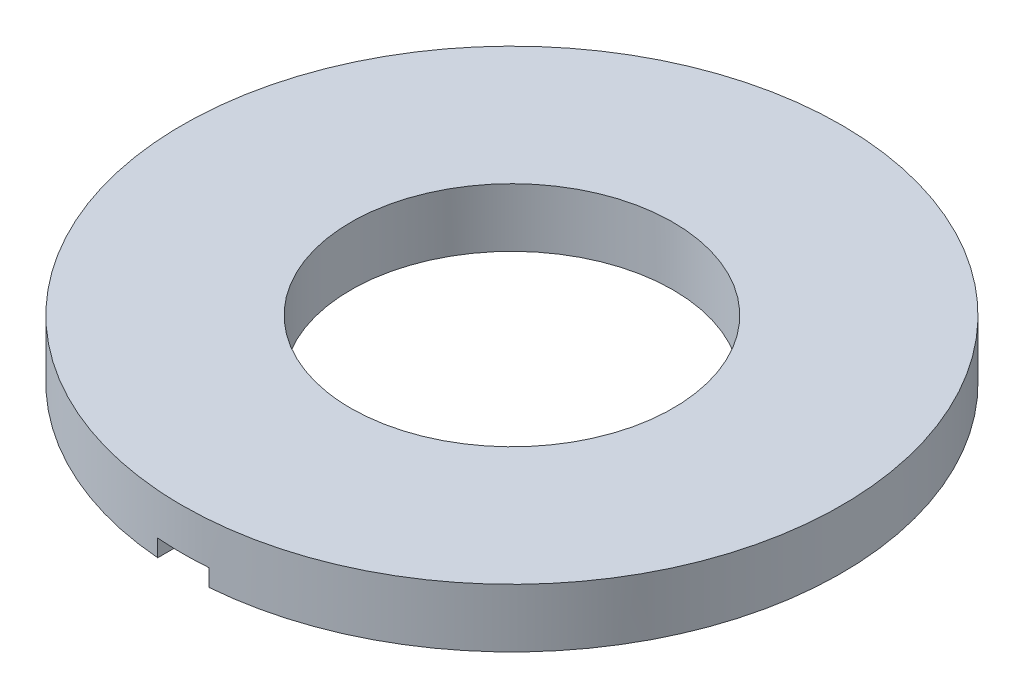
ISO-10303-21;
HEADER;
FILE_DESCRIPTION(('STEP AP214'),'2;1');
FILE_NAME('part.step','',(''),(''),'','','');
FILE_SCHEMA(('AUTOMOTIVE_DESIGN { 1 0 10303 214 1 1 1 1 }'));
ENDSEC;
DATA;
#1=APPLICATION_CONTEXT('core data for automotive mechanical design processes');
#2=APPLICATION_PROTOCOL_DEFINITION('international standard','automotive_design',2000,#1);
#3=PRODUCT_CONTEXT('',#1,'mechanical');
#4=PRODUCT('Part','Part','',(#3));
#5=PRODUCT_RELATED_PRODUCT_CATEGORY('part','',(#4));
#6=PRODUCT_DEFINITION_FORMATION('','',#4);
#7=PRODUCT_DEFINITION_CONTEXT('part definition',#1,'design');
#8=PRODUCT_DEFINITION('design','',#6,#7);
#9=PRODUCT_DEFINITION_SHAPE('','',#8);
#10=(LENGTH_UNIT() NAMED_UNIT(*) SI_UNIT(.MILLI.,.METRE.));
#11=(NAMED_UNIT(*) PLANE_ANGLE_UNIT() SI_UNIT($,.RADIAN.));
#12=(NAMED_UNIT(*) SI_UNIT($,.STERADIAN.) SOLID_ANGLE_UNIT());
#13=UNCERTAINTY_MEASURE_WITH_UNIT(LENGTH_MEASURE(1.E-05),#10,'distance_accuracy_value','');
#14=(GEOMETRIC_REPRESENTATION_CONTEXT(3) GLOBAL_UNCERTAINTY_ASSIGNED_CONTEXT((#13)) GLOBAL_UNIT_ASSIGNED_CONTEXT((#10,
#11,#12)) REPRESENTATION_CONTEXT('',''));
#15=CARTESIAN_POINT('',(0.,0.,0.));
#16=DIRECTION('',(0.,0.,1.));
#17=DIRECTION('',(1.,0.,0.));
#18=AXIS2_PLACEMENT_3D('',#15,#16,#17);
#19=CARTESIAN_POINT('',(0.,0.8,0.));
#20=DIRECTION('',(0.,1.,0.));
#21=DIRECTION('',(0.,0.,1.));
#22=AXIS2_PLACEMENT_3D('',#19,#20,#21);
#23=PLANE('',#22);
#24=CARTESIAN_POINT('',(0.,0.8,0.));
#25=DIRECTION('',(0.,1.,0.));
#26=DIRECTION('',(0.,0.,1.));
#27=AXIS2_PLACEMENT_3D('',#24,#25,#26);
#28=CIRCLE('',#27,4.5);
#29=CARTESIAN_POINT('',(0.,0.8,4.5));
#30=VERTEX_POINT('',#29);
#31=EDGE_CURVE('E113',#30,#30,#28,.T.);
#32=ORIENTED_EDGE('',*,*,#31,.T.);
#33=EDGE_LOOP('',(#32));
#34=FACE_BOUND('',#33,.T.);
#35=CARTESIAN_POINT('',(0.,0.8,0.));
#36=DIRECTION('',(0.,1.,0.));
#37=DIRECTION('',(0.,0.,1.));
#38=AXIS2_PLACEMENT_3D('',#35,#36,#37);
#39=CIRCLE('',#38,2.2);
#40=CARTESIAN_POINT('',(0.,0.8,2.2));
#41=VERTEX_POINT('',#40);
#42=EDGE_CURVE('E102',#41,#41,#39,.T.);
#43=ORIENTED_EDGE('',*,*,#42,.F.);
#44=EDGE_LOOP('',(#43));
#45=FACE_BOUND('',#44,.T.);
#46=ADVANCED_FACE('F39',(#34,#45),#23,.T.);
#47=CARTESIAN_POINT('',(0.,0.,0.));
#48=DIRECTION('',(0.,1.,0.));
#49=DIRECTION('',(0.,0.,1.));
#50=AXIS2_PLACEMENT_3D('',#47,#48,#49);
#51=PLANE('',#50);
#52=CARTESIAN_POINT('',(0.,0.,0.));
#53=DIRECTION('',(0.,1.,0.));
#54=DIRECTION('',(0.,0.,1.));
#55=AXIS2_PLACEMENT_3D('',#52,#53,#54);
#56=CIRCLE('',#55,4.5);
#57=CARTESIAN_POINT('',(0.35,0.,4.48636824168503));
#58=VERTEX_POINT('',#57);
#59=CARTESIAN_POINT('',(-0.35,0.,4.48636824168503));
#60=VERTEX_POINT('',#59);
#61=EDGE_CURVE('E94',#58,#60,#56,.T.);
#62=ORIENTED_EDGE('',*,*,#61,.F.);
#63=DIRECTION('',(0.,0.,1.));
#64=VECTOR('',#63,1.);
#65=CARTESIAN_POINT('',(0.35,0.,-0.0999999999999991));
#66=LINE('',#65,#64);
#67=CARTESIAN_POINT('',(0.35,0.,2.17198066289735));
#68=VERTEX_POINT('',#67);
#69=EDGE_CURVE('E81',#68,#58,#66,.T.);
#70=ORIENTED_EDGE('',*,*,#69,.F.);
#71=CARTESIAN_POINT('',(0.,0.,0.));
#72=DIRECTION('',(0.,1.,0.));
#73=DIRECTION('',(0.,0.,1.));
#74=AXIS2_PLACEMENT_3D('',#71,#72,#73);
#75=CIRCLE('',#74,2.2);
#76=CARTESIAN_POINT('',(-0.35,0.,2.17198066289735));
#77=VERTEX_POINT('',#76);
#78=EDGE_CURVE('E92',#68,#77,#75,.T.);
#79=ORIENTED_EDGE('',*,*,#78,.T.);
#80=DIRECTION('',(0.,0.,-1.));
#81=VECTOR('',#80,1.);
#82=CARTESIAN_POINT('',(-0.35,0.,-0.0999999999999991));
#83=LINE('',#82,#81);
#84=EDGE_CURVE('E96',#60,#77,#83,.T.);
#85=ORIENTED_EDGE('',*,*,#84,.F.);
#86=EDGE_LOOP('',(#62,#70,#79,#85));
#87=FACE_BOUND('',#86,.T.);
#88=ADVANCED_FACE('F90',(#87),#51,.F.);
#89=CARTESIAN_POINT('',(0.,0.8,0.));
#90=DIRECTION('',(0.,-1.,0.));
#91=DIRECTION('',(0.,0.,-1.));
#92=AXIS2_PLACEMENT_3D('',#89,#90,#91);
#93=CYLINDRICAL_SURFACE('',#92,4.5);
#94=ORIENTED_EDGE('',*,*,#31,.F.);
#95=EDGE_LOOP('',(#94));
#96=FACE_BOUND('',#95,.T.);
#97=CARTESIAN_POINT('',(0.,0.233333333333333,0.));
#98=DIRECTION('',(0.,1.,0.));
#99=DIRECTION('',(0.,0.,1.));
#100=AXIS2_PLACEMENT_3D('',#97,#98,#99);
#101=CIRCLE('',#100,4.5);
#102=CARTESIAN_POINT('',(-0.35,0.233333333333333,4.48636824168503));
#103=VERTEX_POINT('',#102);
#104=CARTESIAN_POINT('',(0.35,0.233333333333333,4.48636824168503));
#105=VERTEX_POINT('',#104);
#106=EDGE_CURVE('E60',#103,#105,#101,.T.);
#107=ORIENTED_EDGE('',*,*,#106,.T.);
#108=DIRECTION('',(0.,-1.,0.));
#109=VECTOR('',#108,1.);
#110=CARTESIAN_POINT('',(0.35,0.8,4.48636824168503));
#111=LINE('',#110,#109);
#112=EDGE_CURVE('E103',#105,#58,#111,.T.);
#113=ORIENTED_EDGE('',*,*,#112,.T.);
#114=ORIENTED_EDGE('',*,*,#61,.T.);
#115=DIRECTION('',(0.,-1.,0.));
#116=VECTOR('',#115,1.);
#117=CARTESIAN_POINT('',(-0.35,0.8,4.48636824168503));
#118=LINE('',#117,#116);
#119=EDGE_CURVE('E110',#60,#103,#118,.F.);
#120=ORIENTED_EDGE('',*,*,#119,.T.);
#121=EDGE_LOOP('',(#107,#113,#114,#120));
#122=FACE_BOUND('',#121,.T.);
#123=ADVANCED_FACE('F41',(#96,#122),#93,.T.);
#124=CARTESIAN_POINT('',(0.,0.8,0.));
#125=DIRECTION('',(0.,-1.,0.));
#126=DIRECTION('',(0.,0.,-1.));
#127=AXIS2_PLACEMENT_3D('',#124,#125,#126);
#128=CYLINDRICAL_SURFACE('',#127,2.2);
#129=DIRECTION('',(0.,-1.,0.));
#130=VECTOR('',#129,1.);
#131=CARTESIAN_POINT('',(0.35,0.8,2.17198066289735));
#132=LINE('',#131,#130);
#133=CARTESIAN_POINT('',(0.35,0.233333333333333,2.17198066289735));
#134=VERTEX_POINT('',#133);
#135=EDGE_CURVE('E11',#134,#68,#132,.T.);
#136=ORIENTED_EDGE('',*,*,#135,.F.);
#137=CARTESIAN_POINT('',(0.,0.233333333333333,0.));
#138=DIRECTION('',(0.,1.,0.));
#139=DIRECTION('',(0.,0.,1.));
#140=AXIS2_PLACEMENT_3D('',#137,#138,#139);
#141=CIRCLE('',#140,2.2);
#142=CARTESIAN_POINT('',(-0.35,0.233333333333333,2.17198066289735));
#143=VERTEX_POINT('',#142);
#144=EDGE_CURVE('E117',#143,#134,#141,.T.);
#145=ORIENTED_EDGE('',*,*,#144,.F.);
#146=DIRECTION('',(0.,-1.,0.));
#147=VECTOR('',#146,1.);
#148=CARTESIAN_POINT('',(-0.35,0.8,2.17198066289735));
#149=LINE('',#148,#147);
#150=EDGE_CURVE('E48',#77,#143,#149,.F.);
#151=ORIENTED_EDGE('',*,*,#150,.F.);
#152=ORIENTED_EDGE('',*,*,#78,.F.);
#153=EDGE_LOOP('',(#136,#145,#151,#152));
#154=FACE_BOUND('',#153,.T.);
#155=ORIENTED_EDGE('',*,*,#42,.T.);
#156=EDGE_LOOP('',(#155));
#157=FACE_BOUND('',#156,.T.);
#158=ADVANCED_FACE('F99',(#154,#157),#128,.F.);
#159=CARTESIAN_POINT('',(0.35,0.233333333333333,-0.0999999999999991));
#160=DIRECTION('',(1.,0.,0.));
#161=DIRECTION('',(0.,0.,-1.));
#162=AXIS2_PLACEMENT_3D('',#159,#160,#161);
#163=PLANE('',#162);
#164=DIRECTION('',(0.,0.,1.));
#165=VECTOR('',#164,1.);
#166=CARTESIAN_POINT('',(0.35,0.233333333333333,-0.0999999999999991));
#167=LINE('',#166,#165);
#168=EDGE_CURVE('E83',#134,#105,#167,.T.);
#169=ORIENTED_EDGE('',*,*,#168,.F.);
#170=ORIENTED_EDGE('',*,*,#135,.T.);
#171=ORIENTED_EDGE('',*,*,#69,.T.);
#172=ORIENTED_EDGE('',*,*,#112,.F.);
#173=EDGE_LOOP('',(#169,#170,#171,#172));
#174=FACE_BOUND('',#173,.T.);
#175=ADVANCED_FACE('F79',(#174),#163,.F.);
#176=CARTESIAN_POINT('',(-0.35,0.233333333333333,-0.0999999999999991));
#177=DIRECTION('',(-1.,0.,0.));
#178=DIRECTION('',(0.,0.,1.));
#179=AXIS2_PLACEMENT_3D('',#176,#177,#178);
#180=PLANE('',#179);
#181=ORIENTED_EDGE('',*,*,#84,.T.);
#182=ORIENTED_EDGE('',*,*,#150,.T.);
#183=DIRECTION('',(0.,0.,-1.));
#184=VECTOR('',#183,1.);
#185=CARTESIAN_POINT('',(-0.35,0.233333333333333,-0.0999999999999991));
#186=LINE('',#185,#184);
#187=EDGE_CURVE('E55',#103,#143,#186,.T.);
#188=ORIENTED_EDGE('',*,*,#187,.F.);
#189=ORIENTED_EDGE('',*,*,#119,.F.);
#190=EDGE_LOOP('',(#181,#182,#188,#189));
#191=FACE_BOUND('',#190,.T.);
#192=ADVANCED_FACE('F123',(#191),#180,.F.);
#193=CARTESIAN_POINT('',(0.,0.233333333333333,0.));
#194=DIRECTION('',(0.,1.,0.));
#195=DIRECTION('',(0.,0.,1.));
#196=AXIS2_PLACEMENT_3D('',#193,#194,#195);
#197=PLANE('',#196);
#198=ORIENTED_EDGE('',*,*,#106,.F.);
#199=ORIENTED_EDGE('',*,*,#187,.T.);
#200=ORIENTED_EDGE('',*,*,#144,.T.);
#201=ORIENTED_EDGE('',*,*,#168,.T.);
#202=EDGE_LOOP('',(#198,#199,#200,#201));
#203=FACE_BOUND('',#202,.T.);
#204=ADVANCED_FACE('F125',(#203),#197,.F.);
#205=CLOSED_SHELL('',(#46,#88,#123,#158,#175,#192,#204));
#206=MANIFOLD_SOLID_BREP('B2',#205);
#207=ADVANCED_BREP_SHAPE_REPRESENTATION('',(#18,#206),#14);
#208=SHAPE_DEFINITION_REPRESENTATION(#9,#207);
ENDSEC;
END-ISO-10303-21;
